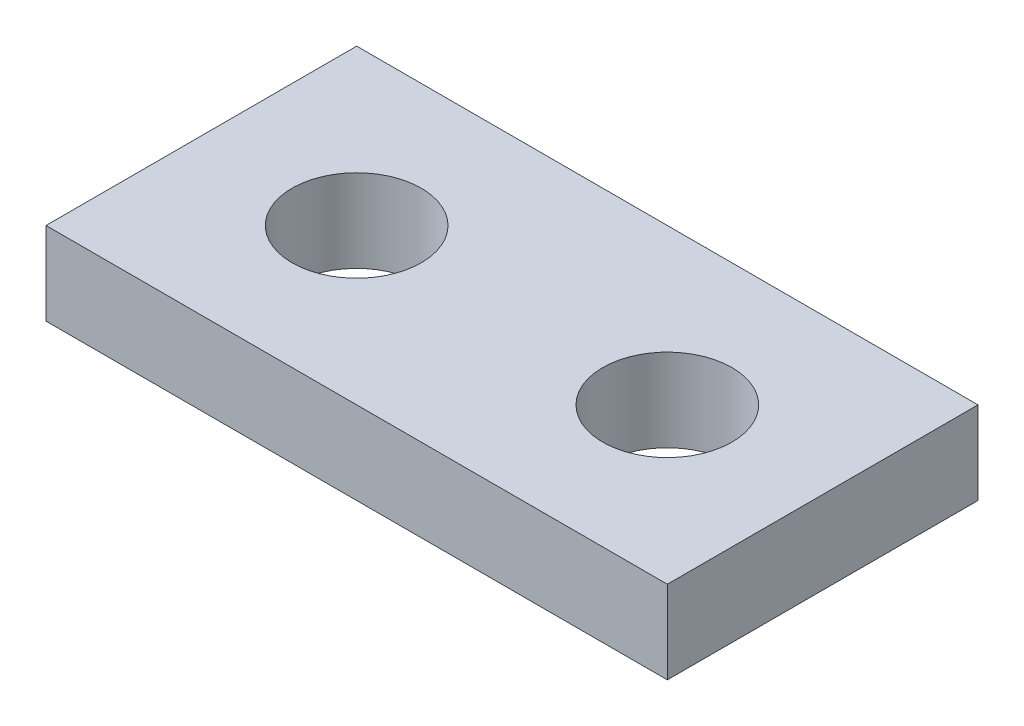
ISO-10303-21;
HEADER;
FILE_DESCRIPTION(('STEP AP214'),'2;1');
FILE_NAME('part.step','',(''),(''),'','','');
FILE_SCHEMA(('AUTOMOTIVE_DESIGN { 1 0 10303 214 1 1 1 1 }'));
ENDSEC;
DATA;
#1=APPLICATION_CONTEXT('core data for automotive mechanical design processes');
#2=APPLICATION_PROTOCOL_DEFINITION('international standard','automotive_design',2000,#1);
#3=PRODUCT_CONTEXT('',#1,'mechanical');
#4=PRODUCT('Part','Part','',(#3));
#5=PRODUCT_RELATED_PRODUCT_CATEGORY('part','',(#4));
#6=PRODUCT_DEFINITION_FORMATION('','',#4);
#7=PRODUCT_DEFINITION_CONTEXT('part definition',#1,'design');
#8=PRODUCT_DEFINITION('design','',#6,#7);
#9=PRODUCT_DEFINITION_SHAPE('','',#8);
#10=(LENGTH_UNIT() NAMED_UNIT(*) SI_UNIT(.MILLI.,.METRE.));
#11=(NAMED_UNIT(*) PLANE_ANGLE_UNIT() SI_UNIT($,.RADIAN.));
#12=(NAMED_UNIT(*) SI_UNIT($,.STERADIAN.) SOLID_ANGLE_UNIT());
#13=UNCERTAINTY_MEASURE_WITH_UNIT(LENGTH_MEASURE(1.E-05),#10,'distance_accuracy_value','');
#14=(GEOMETRIC_REPRESENTATION_CONTEXT(3) GLOBAL_UNCERTAINTY_ASSIGNED_CONTEXT((#13)) GLOBAL_UNIT_ASSIGNED_CONTEXT((#10,
#11,#12)) REPRESENTATION_CONTEXT('',''));
#15=CARTESIAN_POINT('',(0.,0.,0.));
#16=DIRECTION('',(0.,0.,1.));
#17=DIRECTION('',(1.,0.,0.));
#18=AXIS2_PLACEMENT_3D('',#15,#16,#17);
#19=CARTESIAN_POINT('',(0.,2.54,0.));
#20=DIRECTION('',(0.,-1.,0.));
#21=DIRECTION('',(0.,0.,-1.));
#22=AXIS2_PLACEMENT_3D('',#19,#20,#21);
#23=PLANE('',#22);
#24=CARTESIAN_POINT('',(-4.7625,2.54,0.));
#25=DIRECTION('',(0.,1.,0.));
#26=DIRECTION('',(0.,0.,1.));
#27=AXIS2_PLACEMENT_3D('',#24,#25,#26);
#28=CIRCLE('',#27,1.9812);
#29=CARTESIAN_POINT('',(-4.7625,2.54,1.9812));
#30=VERTEX_POINT('',#29);
#31=EDGE_CURVE('E102',#30,#30,#28,.T.);
#32=ORIENTED_EDGE('',*,*,#31,.F.);
#33=EDGE_LOOP('',(#32));
#34=FACE_BOUND('',#33,.T.);
#35=DIRECTION('',(0.,0.,-1.));
#36=VECTOR('',#35,1.);
#37=CARTESIAN_POINT('',(9.525,2.54,4.7625));
#38=LINE('',#37,#36);
#39=CARTESIAN_POINT('',(9.525,2.54,4.7625));
#40=VERTEX_POINT('',#39);
#41=CARTESIAN_POINT('',(9.525,2.54,-4.7625));
#42=VERTEX_POINT('',#41);
#43=EDGE_CURVE('E87',#40,#42,#38,.T.);
#44=ORIENTED_EDGE('',*,*,#43,.T.);
#45=DIRECTION('',(-1.,0.,0.));
#46=VECTOR('',#45,1.);
#47=CARTESIAN_POINT('',(-9.525,2.54,-4.7625));
#48=LINE('',#47,#46);
#49=CARTESIAN_POINT('',(-9.525,2.54,-4.7625));
#50=VERTEX_POINT('',#49);
#51=EDGE_CURVE('E82',#42,#50,#48,.T.);
#52=ORIENTED_EDGE('',*,*,#51,.T.);
#53=DIRECTION('',(0.,0.,1.));
#54=VECTOR('',#53,1.);
#55=CARTESIAN_POINT('',(-9.525,2.54,4.7625));
#56=LINE('',#55,#54);
#57=CARTESIAN_POINT('',(-9.525,2.54,4.7625));
#58=VERTEX_POINT('',#57);
#59=EDGE_CURVE('E85',#50,#58,#56,.T.);
#60=ORIENTED_EDGE('',*,*,#59,.T.);
#61=DIRECTION('',(1.,0.,0.));
#62=VECTOR('',#61,1.);
#63=CARTESIAN_POINT('',(-9.525,2.54,4.7625));
#64=LINE('',#63,#62);
#65=EDGE_CURVE('E52',#58,#40,#64,.T.);
#66=ORIENTED_EDGE('',*,*,#65,.T.);
#67=EDGE_LOOP('',(#44,#52,#60,#66));
#68=FACE_BOUND('',#67,.T.);
#69=CARTESIAN_POINT('',(4.7625,2.54,0.));
#70=DIRECTION('',(0.,1.,0.));
#71=DIRECTION('',(0.,0.,-1.));
#72=AXIS2_PLACEMENT_3D('',#69,#70,#71);
#73=CIRCLE('',#72,1.9812);
#74=CARTESIAN_POINT('',(4.7625,2.54,-1.9812));
#75=VERTEX_POINT('',#74);
#76=EDGE_CURVE('E117',#75,#75,#73,.T.);
#77=ORIENTED_EDGE('',*,*,#76,.F.);
#78=EDGE_LOOP('',(#77));
#79=FACE_BOUND('',#78,.T.);
#80=ADVANCED_FACE('F35',(#34,#68,#79),#23,.F.);
#81=CARTESIAN_POINT('',(0.,0.,0.));
#82=DIRECTION('',(0.,-1.,0.));
#83=DIRECTION('',(0.,0.,-1.));
#84=AXIS2_PLACEMENT_3D('',#81,#82,#83);
#85=PLANE('',#84);
#86=CARTESIAN_POINT('',(-4.7625,0.,0.));
#87=DIRECTION('',(0.,1.,0.));
#88=DIRECTION('',(0.,0.,1.));
#89=AXIS2_PLACEMENT_3D('',#86,#87,#88);
#90=CIRCLE('',#89,1.9812);
#91=CARTESIAN_POINT('',(-4.7625,0.,1.9812));
#92=VERTEX_POINT('',#91);
#93=EDGE_CURVE('E114',#92,#92,#90,.T.);
#94=ORIENTED_EDGE('',*,*,#93,.T.);
#95=EDGE_LOOP('',(#94));
#96=FACE_BOUND('',#95,.T.);
#97=DIRECTION('',(0.,0.,-1.));
#98=VECTOR('',#97,1.);
#99=CARTESIAN_POINT('',(9.525,0.,4.7625));
#100=LINE('',#99,#98);
#101=CARTESIAN_POINT('',(9.525,0.,4.7625));
#102=VERTEX_POINT('',#101);
#103=CARTESIAN_POINT('',(9.525,0.,-4.7625));
#104=VERTEX_POINT('',#103);
#105=EDGE_CURVE('E99',#102,#104,#100,.T.);
#106=ORIENTED_EDGE('',*,*,#105,.F.);
#107=DIRECTION('',(1.,0.,0.));
#108=VECTOR('',#107,1.);
#109=CARTESIAN_POINT('',(-9.525,0.,4.7625));
#110=LINE('',#109,#108);
#111=CARTESIAN_POINT('',(-9.525,0.,4.7625));
#112=VERTEX_POINT('',#111);
#113=EDGE_CURVE('E75',#112,#102,#110,.T.);
#114=ORIENTED_EDGE('',*,*,#113,.F.);
#115=DIRECTION('',(0.,0.,1.));
#116=VECTOR('',#115,1.);
#117=CARTESIAN_POINT('',(-9.525,0.,4.7625));
#118=LINE('',#117,#116);
#119=CARTESIAN_POINT('',(-9.525,0.,-4.7625));
#120=VERTEX_POINT('',#119);
#121=EDGE_CURVE('E69',#120,#112,#118,.T.);
#122=ORIENTED_EDGE('',*,*,#121,.F.);
#123=DIRECTION('',(-1.,0.,0.));
#124=VECTOR('',#123,1.);
#125=CARTESIAN_POINT('',(-9.525,0.,-4.7625));
#126=LINE('',#125,#124);
#127=EDGE_CURVE('E91',#104,#120,#126,.T.);
#128=ORIENTED_EDGE('',*,*,#127,.F.);
#129=EDGE_LOOP('',(#106,#114,#122,#128));
#130=FACE_BOUND('',#129,.T.);
#131=CARTESIAN_POINT('',(4.7625,0.,0.));
#132=DIRECTION('',(0.,1.,0.));
#133=DIRECTION('',(0.,0.,-1.));
#134=AXIS2_PLACEMENT_3D('',#131,#132,#133);
#135=CIRCLE('',#134,1.9812);
#136=CARTESIAN_POINT('',(4.7625,0.,-1.9812));
#137=VERTEX_POINT('',#136);
#138=EDGE_CURVE('E120',#137,#137,#135,.T.);
#139=ORIENTED_EDGE('',*,*,#138,.T.);
#140=EDGE_LOOP('',(#139));
#141=FACE_BOUND('',#140,.T.);
#142=ADVANCED_FACE('F110',(#96,#130,#141),#85,.T.);
#143=CARTESIAN_POINT('',(9.525,2.54,4.7625));
#144=DIRECTION('',(-1.,0.,0.));
#145=DIRECTION('',(0.,0.,1.));
#146=AXIS2_PLACEMENT_3D('',#143,#144,#145);
#147=PLANE('',#146);
#148=ORIENTED_EDGE('',*,*,#105,.T.);
#149=DIRECTION('',(0.,-1.,0.));
#150=VECTOR('',#149,1.);
#151=CARTESIAN_POINT('',(9.525,2.54,-4.7625));
#152=LINE('',#151,#150);
#153=EDGE_CURVE('E11',#42,#104,#152,.T.);
#154=ORIENTED_EDGE('',*,*,#153,.F.);
#155=ORIENTED_EDGE('',*,*,#43,.F.);
#156=DIRECTION('',(0.,-1.,0.));
#157=VECTOR('',#156,1.);
#158=CARTESIAN_POINT('',(9.525,2.54,4.7625));
#159=LINE('',#158,#157);
#160=EDGE_CURVE('E95',#40,#102,#159,.T.);
#161=ORIENTED_EDGE('',*,*,#160,.T.);
#162=EDGE_LOOP('',(#148,#154,#155,#161));
#163=FACE_BOUND('',#162,.T.);
#164=ADVANCED_FACE('F37',(#163),#147,.F.);
#165=CARTESIAN_POINT('',(-9.525,2.54,-4.7625));
#166=DIRECTION('',(0.,0.,1.));
#167=DIRECTION('',(1.,0.,0.));
#168=AXIS2_PLACEMENT_3D('',#165,#166,#167);
#169=PLANE('',#168);
#170=ORIENTED_EDGE('',*,*,#127,.T.);
#171=DIRECTION('',(0.,-1.,0.));
#172=VECTOR('',#171,1.);
#173=CARTESIAN_POINT('',(-9.525,2.54,-4.7625));
#174=LINE('',#173,#172);
#175=EDGE_CURVE('E44',#50,#120,#174,.T.);
#176=ORIENTED_EDGE('',*,*,#175,.F.);
#177=ORIENTED_EDGE('',*,*,#51,.F.);
#178=ORIENTED_EDGE('',*,*,#153,.T.);
#179=EDGE_LOOP('',(#170,#176,#177,#178));
#180=FACE_BOUND('',#179,.T.);
#181=ADVANCED_FACE('F90',(#180),#169,.F.);
#182=CARTESIAN_POINT('',(-9.525,2.54,4.7625));
#183=DIRECTION('',(1.,0.,0.));
#184=DIRECTION('',(0.,0.,-1.));
#185=AXIS2_PLACEMENT_3D('',#182,#183,#184);
#186=PLANE('',#185);
#187=ORIENTED_EDGE('',*,*,#121,.T.);
#188=DIRECTION('',(0.,-1.,0.));
#189=VECTOR('',#188,1.);
#190=CARTESIAN_POINT('',(-9.525,2.54,4.7625));
#191=LINE('',#190,#189);
#192=EDGE_CURVE('E92',#58,#112,#191,.T.);
#193=ORIENTED_EDGE('',*,*,#192,.F.);
#194=ORIENTED_EDGE('',*,*,#59,.F.);
#195=ORIENTED_EDGE('',*,*,#175,.T.);
#196=EDGE_LOOP('',(#187,#193,#194,#195));
#197=FACE_BOUND('',#196,.T.);
#198=ADVANCED_FACE('F93',(#197),#186,.F.);
#199=CARTESIAN_POINT('',(-9.525,2.54,4.7625));
#200=DIRECTION('',(0.,0.,-1.));
#201=DIRECTION('',(-1.,0.,0.));
#202=AXIS2_PLACEMENT_3D('',#199,#200,#201);
#203=PLANE('',#202);
#204=ORIENTED_EDGE('',*,*,#113,.T.);
#205=ORIENTED_EDGE('',*,*,#160,.F.);
#206=ORIENTED_EDGE('',*,*,#65,.F.);
#207=ORIENTED_EDGE('',*,*,#192,.T.);
#208=EDGE_LOOP('',(#204,#205,#206,#207));
#209=FACE_BOUND('',#208,.T.);
#210=ADVANCED_FACE('F107',(#209),#203,.F.);
#211=CARTESIAN_POINT('',(-4.7625,2.54,0.));
#212=DIRECTION('',(0.,-1.,0.));
#213=DIRECTION('',(0.,0.,-1.));
#214=AXIS2_PLACEMENT_3D('',#211,#212,#213);
#215=CYLINDRICAL_SURFACE('',#214,1.9812);
#216=ORIENTED_EDGE('',*,*,#31,.T.);
#217=EDGE_LOOP('',(#216));
#218=FACE_BOUND('',#217,.T.);
#219=ORIENTED_EDGE('',*,*,#93,.F.);
#220=EDGE_LOOP('',(#219));
#221=FACE_BOUND('',#220,.T.);
#222=ADVANCED_FACE('F138',(#218,#221),#215,.F.);
#223=CARTESIAN_POINT('',(4.7625,2.54,0.));
#224=DIRECTION('',(0.,-1.,0.));
#225=DIRECTION('',(0.,0.,-1.));
#226=AXIS2_PLACEMENT_3D('',#223,#224,#225);
#227=CYLINDRICAL_SURFACE('',#226,1.9812);
#228=ORIENTED_EDGE('',*,*,#76,.T.);
#229=EDGE_LOOP('',(#228));
#230=FACE_BOUND('',#229,.T.);
#231=ORIENTED_EDGE('',*,*,#138,.F.);
#232=EDGE_LOOP('',(#231));
#233=FACE_BOUND('',#232,.T.);
#234=ADVANCED_FACE('F126',(#230,#233),#227,.F.);
#235=CLOSED_SHELL('',(#80,#142,#164,#181,#198,#210,#222,#234));
#236=MANIFOLD_SOLID_BREP('B2',#235);
#237=ADVANCED_BREP_SHAPE_REPRESENTATION('',(#18,#236),#14);
#238=SHAPE_DEFINITION_REPRESENTATION(#9,#237);
ENDSEC;
END-ISO-10303-21;
